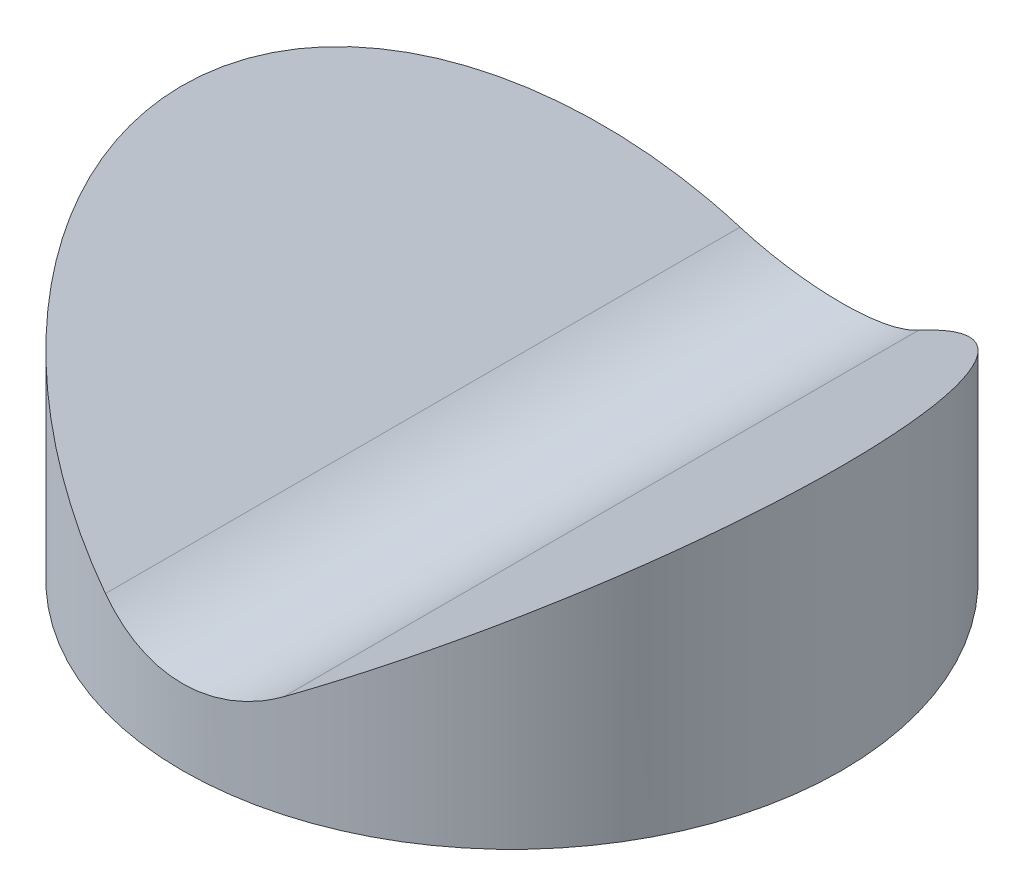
from build123d import *

# Parameters (mm, degrees)
SKETCH1_R                            = 3.5
BOSS_EXTRUDE1_DEPTH                  = 0.8
BOSS_EXTRUDE2_REACH                  = 7.014
BOSS_EXTRUDE2_END_RADIUS             = 3.5
BOSS_EXTRUDE2_DIRECTION_2_REACH      = 7.014
BOSS_EXTRUDE2_DIRECTION_2_END_RADIUS = 3.5


with BuildPart() as part:
    # Sketch1 → Boss-Extrude1 (new body)
    with BuildSketch(Plane(origin=(0, 0, 0), x_dir=(1, 0, 0), z_dir=(0, 1, 0))):
        with Locations(Location((0, 0, 0), (0, 0, 270))):
            Circle(SKETCH1_R)
    extrude(amount=BOSS_EXTRUDE1_DEPTH)

    # Boss-Extrude2: up to this cylinder (the profile starts inside it)
    boss_extrude2_end = Plane(origin=(0, 1.881596, 0), z_dir=(0, -1, 0)) * Cylinder(BOSS_EXTRUDE2_END_RADIUS, 22.028, mode=Mode.PRIVATE)
    # Sketch3 → Boss-Extrude2 (add, up to the surface)
    with BuildSketch(Plane.XY, mode=Mode.PRIVATE) as boss_extrude2_sk1:
        with BuildLine():
            Line((-3.5, 0.8), (-3.5, 2.8))
            Line((-3.5, 2.8), (-0.947883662, 1.088421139))
            ThreePointArc((-0.947883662, 1.088421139), (0, 0.8), (0.947883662, 1.088421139))
            Line((0.947883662, 1.088421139), (3.5, 2.8))
            Line((3.5, 2.8), (3.5, 0.8))
            Line((3.5, 0.8), (3.5, 0))
            Line((3.5, 0), (-3.5, 0))
            Line((-3.5, 0), (-3.5, 0.8))
        make_face()
    boss_extrude2_tool1 = extrude(boss_extrude2_sk1.sketch, amount=BOSS_EXTRUDE2_REACH, mode=Mode.PRIVATE) & boss_extrude2_end
    add(boss_extrude2_tool1.solids().sort_by_distance((2.265935, 1.881596, 0))[0])

    # Boss-Extrude2 direction 2: up to this cylinder (the profile starts inside it)
    boss_extrude2_direction_2_end = Plane(origin=(0, 1.881596, 0), z_dir=(0, -1, 0)) * Cylinder(BOSS_EXTRUDE2_DIRECTION_2_END_RADIUS, 22.028, mode=Mode.PRIVATE)
    # Sketch3 → Boss-Extrude2 direction 2 (add, up to the surface)
    with BuildSketch(Plane.XY, mode=Mode.PRIVATE) as boss_extrude2_direction_2_sk1:
        with BuildLine():
            Line((-3.5, 0.8), (-3.5, 2.8))
            Line((-3.5, 2.8), (-0.947883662, 1.088421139))
            ThreePointArc((-0.947883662, 1.088421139), (0, 0.8), (0.947883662, 1.088421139))
            Line((0.947883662, 1.088421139), (3.5, 2.8))
            Line((3.5, 2.8), (3.5, 0.8))
            Line((3.5, 0.8), (3.5, 0))
            Line((3.5, 0), (-3.5, 0))
            Line((-3.5, 0), (-3.5, 0.8))
        make_face()
    boss_extrude2_direction_2_tool1 = extrude(boss_extrude2_direction_2_sk1.sketch, amount=-BOSS_EXTRUDE2_DIRECTION_2_REACH, mode=Mode.PRIVATE) & boss_extrude2_direction_2_end
    add(boss_extrude2_direction_2_tool1.solids().sort_by_distance((2.265935, 1.881596, 0))[0])


solid = part.part
